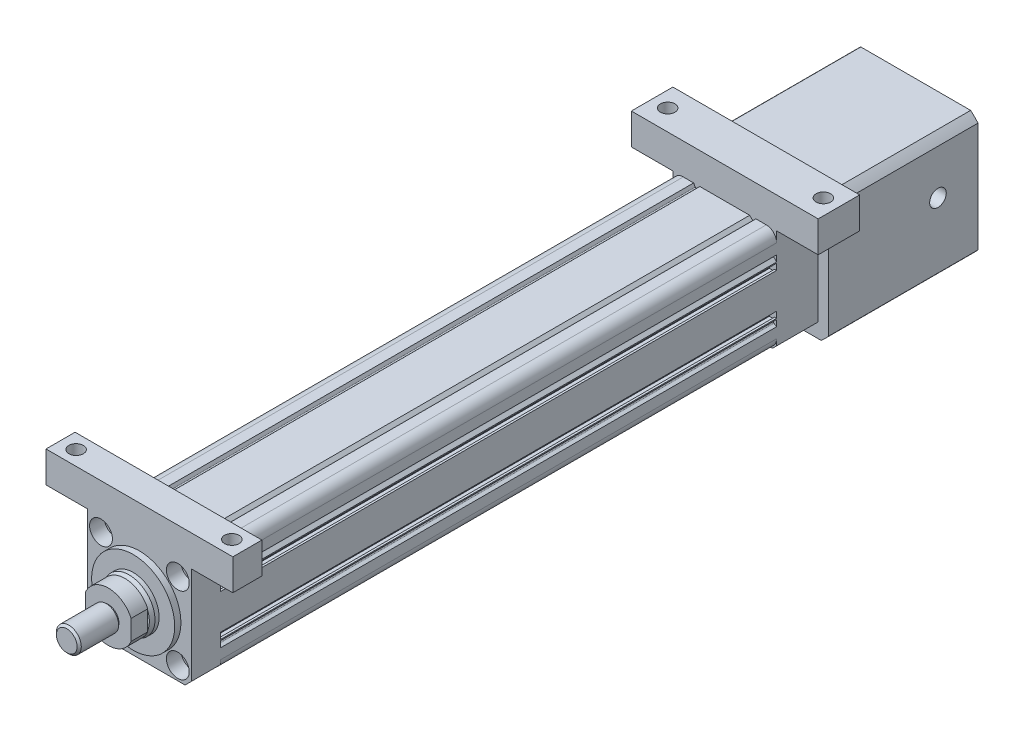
from build123d import *

# Parameters (mm, degrees)
SKETCH_1_R                  = 20
SKETCH_1_R_2                = 2.75
EXTRUDE_1_DEPTH             = 268
FILLET_1_R                  = 5
EXTRUDE_2_DEPTH             = 14
SKETCH_3_R                  = 20
EXTRUDE_3_DEPTH             = 3
SKETCH_5_R                  = 12.5
EXTRUDE_4_DEPTH             = 4
CHAMFER_1_SIZE              = 2
CHAMFER_1_SIZE2             = 0.7
EXTRUDE_5_DEPTH             = 8
SKETCH_7_R                  = 5.15
EXTRUDE_6_DEPTH             = 1
SKETCH_8_R                  = 6
EXTRUDE_7_DEPTH             = 19
CHAMFER_2_SIZE              = 1
SKETCH_23_W                 = 50
SKETCH_23_H                 = 50
EXTRUDE_8_DEPTH             = 20
HOLE_WIZARD_M6_1_D          = 5
HOLE_WIZARD_M6_1_DEPTH      = 7
HOLE_WIZARD_M6_1_TIP        = 1.502151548
SKETCH_28_W                 = 60
SKETCH_28_H                 = 60
EXTRUDE_9_DEPTH             = 72
SKETCH_4_R                  = 3.5
CUT_EXTRUDE_5_DEPTH         = 30
SKETCH_4_6_R                = 5.5
CUT_EXTRUDE_6_DEPTH         = 7
CUT_EXTRUDE_START           = -72
SKETCH_30_R                 = 3.5
CUT_EXTRUDE_7_DEPTH         = 72
CUT_EXTRUDE_START_2         = -50
SKETCH_30_4_R               = 5.5
CUT_EXTRUDE_8_DEPTH         = 50
HOLE_WIZARD_M5_1_AT_2_COUNT = 2
HOLE_WIZARD_M5_1_AT_2_PITCH = 49.497474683
HOLE_WIZARD_M5_1_AT_3_COUNT = 2
HOLE_WIZARD_M5_1_AT_3_PITCH = 70
HOLE_WIZARD_M5_1_AT_4_COUNT = 2
HOLE_WIZARD_M5_1_AT_4_PITCH = 49.497474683
SKETCH_33_R                 = 19
CUT_EXTRUDE_9_DEPTH         = 65
SKETCH_33_3_R               = 25
CUT_EXTRUDE_10_DEPTH        = 6.5
SKETCH_34_R                 = 50
SKETCH_34_R_2               = 40
CUT_EXTRUDE_2_DEPTH         = 72
SKETCH_35_R                 = 4
CUT_EXTRUDE_11_DEPTH        = 22
SKETCH_36_R                 = 4
CUT_EXTRUDE_12_DEPTH        = 22
SKETCH_37_W                 = 90
SKETCH_37_H                 = 20
SKETCH_37_R                 = 3.5
SKETCH_37_H_2               = 14
EXTRUDE_10_DEPTH            = 15
CHAMFER_4_SIZE              = 2


with BuildPart() as part:
    # Sketch 1 → Extrude 1 (new body)
    with BuildSketch(Plane.XY):
        with BuildLine():
            Line((-25, 25), (-15, 25))
            Line((-15, 25), (-14.227730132, 23.662389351))
            ThreePointArc((-14.227730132, 23.662389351), (-13.859980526, 23.416666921), (-13.441164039, 23.558835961))
            Line((-13.441164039, 23.558835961), (-12, 25))
            Line((-12, 25), (12, 25))
            Line((12, 25), (13.441164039, 23.558835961))
            ThreePointArc((13.441164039, 23.558835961), (13.859980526, 23.416666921), (14.227730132, 23.662389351))
            Line((14.227730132, 23.662389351), (15, 25))
            Line((15, 25), (25, 25))
            Line((25, 25), (25, 15))
            Line((25, 15), (23.662389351, 14.227730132))
            ThreePointArc((23.662389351, 14.227730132), (23.416666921, 13.859980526), (23.558835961, 13.441164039))
            Line((23.558835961, 13.441164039), (25, 12))
            Line((25, 12), (25, 11.5))
            Line((25, 11.5), (24, 11.5))
            Line((24, 11.5), (24, 12.4))
            Line((24, 12.4), (21.5, 12.4))
            Line((21.5, 12.4), (21.5, 7.6))
            Line((21.5, 7.6), (24, 7.6))
            Line((24, 7.6), (24, 8.5))
            Line((24, 8.5), (25, 8.5))
            Line((25, 8.5), (25, -8.5))
            Line((25, -8.5), (24, -8.5))
            Line((24, -8.5), (24, -7.6))
            Line((24, -7.6), (21.5, -7.6))
            Line((21.5, -7.6), (21.5, -12.4))
            Line((21.5, -12.4), (24, -12.4))
            Line((24, -12.4), (24, -11.5))
            Line((24, -11.5), (25, -11.5))
            Line((25, -11.5), (25, -12))
            Line((25, -12), (23.558835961, -13.441164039))
            ThreePointArc((23.558835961, -13.441164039), (23.416666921, -13.859980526), (23.662389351, -14.227730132))
            Line((23.662389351, -14.227730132), (25, -15))
            Line((25, -15), (25, -25))
            Line((25, -25), (15, -25))
            Line((15, -25), (14.227730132, -23.662389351))
            ThreePointArc((14.227730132, -23.662389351), (13.859980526, -23.416666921), (13.441164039, -23.558835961))
            Line((13.441164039, -23.558835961), (12, -25))
            Line((12, -25), (11.5, -25))
            Line((11.5, -25), (11.5, -24))
            Line((11.5, -24), (12.4, -24))
            Line((12.4, -24), (12.4, -21.5))
            Line((12.4, -21.5), (7.6, -21.5))
            Line((7.6, -21.5), (7.6, -24))
            Line((7.6, -24), (8.5, -24))
            Line((8.5, -24), (8.5, -25))
            Line((8.5, -25), (-8.5, -25))
            Line((-8.5, -25), (-8.5, -24))
            Line((-8.5, -24), (-7.6, -24))
            Line((-7.6, -24), (-7.6, -21.5))
            Line((-7.6, -21.5), (-12.4, -21.5))
            Line((-12.4, -21.5), (-12.4, -24))
            Line((-12.4, -24), (-11.5, -24))
            Line((-11.5, -24), (-11.5, -25))
            Line((-11.5, -25), (-12, -25))
            Line((-12, -25), (-13.441164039, -23.558835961))
            ThreePointArc((-13.441164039, -23.558835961), (-13.859980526, -23.416666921), (-14.227730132, -23.662389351))
            Line((-14.227730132, -23.662389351), (-15, -25))
            Line((-15, -25), (-25, -25))
            Line((-25, -25), (-25, -15))
            Line((-25, -15), (-23.662389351, -14.227730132))
            ThreePointArc((-23.662389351, -14.227730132), (-23.416666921, -13.859980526), (-23.558835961, -13.441164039))
            Line((-23.558835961, -13.441164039), (-25, -12))
            Line((-25, -12), (-25, -11.5))
            Line((-25, -11.5), (-24, -11.5))
            Line((-24, -11.5), (-24, -12.4))
            Line((-24, -12.4), (-21.5, -12.4))
            Line((-21.5, -12.4), (-21.5, -7.6))
            Line((-21.5, -7.6), (-24, -7.6))
            Line((-24, -7.6), (-24, -8.5))
            Line((-24, -8.5), (-25, -8.5))
            Line((-25, -8.5), (-25, 8.5))
            Line((-25, 8.5), (-24, 8.5))
            Line((-24, 8.5), (-24, 7.6))
            Line((-24, 7.6), (-21.5, 7.6))
            Line((-21.5, 7.6), (-21.5, 12.4))
            Line((-21.5, 12.4), (-24, 12.4))
            Line((-24, 12.4), (-24, 11.5))
            Line((-24, 11.5), (-25, 11.5))
            Line((-25, 11.5), (-25, 12))
            Line((-25, 12), (-23.558835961, 13.441164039))
            ThreePointArc((-23.558835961, 13.441164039), (-23.416666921, 13.859980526), (-23.662389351, 14.227730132))
            Line((-23.662389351, 14.227730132), (-25, 15))
            Line((-25, 15), (-25, 25))
        make_face()
        Circle(SKETCH_1_R, mode=Mode.SUBTRACT)
        with Locations((-18.5, 18.5)):
            Circle(SKETCH_1_R_2, mode=Mode.SUBTRACT)
        with Locations((18.5, 18.5)):
            Circle(SKETCH_1_R_2, mode=Mode.SUBTRACT)
        with Locations((18.5, -18.5)):
            Circle(SKETCH_1_R_2, mode=Mode.SUBTRACT)
        with Locations((-18.5, -18.5)):
            Circle(SKETCH_1_R_2, mode=Mode.SUBTRACT)
        with BuildLine():
            Line((-13.868836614, 23), (-5, 23))
            ThreePointArc((-5, 23), (-4.502985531, 22.554558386), (-4.891534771, 22.01190647))
            ThreePointArc((-4.891534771, 22.01190647), (-10.498377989, 19.955831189), (-15.368836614, 16.5))
            Line((-15.368836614, 16.5), (-15.368836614, 21.5))
            Line((-15.368836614, 21.5), (-13.868836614, 23))
        make_face(mode=Mode.SUBTRACT)
        with BuildLine():
            Line((15.368836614, 16.5), (15.368836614, 21.5))
            Line((15.368836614, 21.5), (13.868836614, 23))
            Line((13.868836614, 23), (5, 23))
            ThreePointArc((5, 23), (4.502985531, 22.554558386), (4.891534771, 22.01190647))
            ThreePointArc((4.891534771, 22.01190647), (10.498377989, 19.955831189), (15.368836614, 16.5))
        make_face(mode=Mode.SUBTRACT)
    extrude(amount=EXTRUDE_1_DEPTH)

    # Fillet 1
    fillet_1_edges = [part.edges().sort_by_distance(p)[0] for p in [
        (-25, 25, 134),
        (25, 25, 134),
        (25, -25, 134),
        (-25, -25, 134),
    ]]
    fillet(fillet_1_edges, radius=FILLET_1_R)

    # Sketch 2 → Extrude 2 (add)
    with BuildSketch(Plane.XY.offset(268)):
        Polygon((-22, 25), (22, 25), (25, 25), (25, 22), (25, -22), (22, -25), (-22, -25), (-25, -22), (-25, 22), (-25, 25), align=None)
    extrude(amount=EXTRUDE_2_DEPTH)

    # Sketch 3 → Extrude 3 (add)
    with BuildSketch(Plane.XY.offset(282)):
        Circle(SKETCH_3_R)
    extrude(amount=EXTRUDE_3_DEPTH)

    # Sketch 5 → Extrude 4 (add)
    with BuildSketch(Plane.XY.offset(285)):
        Circle(SKETCH_5_R)
    extrude(amount=EXTRUDE_4_DEPTH)

    # Chamfer 1
    chamfer_1_edges = [part.edges().sort_by_distance(p)[0] for p in [
        (-12.5, 0, 289),
    ]]
    chamfer_1_side = [part.faces().sort_by_distance(p)[0] for p in [
        (-12.5, 0, 287),
    ]]
    chamfer(chamfer_1_edges, length=CHAMFER_1_SIZE, length2=CHAMFER_1_SIZE2, reference=chamfer_1_side[0])

    # Sketch 6 → Extrude 5 (add)
    with BuildSketch(Plane.XY.offset(289)):
        with BuildLine():
            Line((-11, 4.795831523), (-11, -4.795831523))
            ThreePointArc((-11, -4.795831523), (0, -12), (11, -4.795831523))
            Line((11, -4.795831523), (11, 4.795831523))
            ThreePointArc((11, 4.795831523), (0, 12), (-11, 4.795831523))
        make_face()
    extrude(amount=EXTRUDE_5_DEPTH)

    # Sketch 7 → Extrude 6 (add)
    with BuildSketch(Plane.XY.offset(297)):
        Circle(SKETCH_7_R)
    extrude(amount=EXTRUDE_6_DEPTH)

    # Sketch 8 → Extrude 7 (add)
    with BuildSketch(Plane.XY.offset(298)):
        Circle(SKETCH_8_R)
    extrude(amount=EXTRUDE_7_DEPTH)

    # Chamfer 2
    chamfer_2_edges = [part.edges().sort_by_distance(p)[0] for p in [
        (-6, 0, 317),
    ]]
    chamfer(chamfer_2_edges, length=CHAMFER_2_SIZE)

    # Sketch 23 → Extrude 8 (add)
    with BuildSketch(Plane(origin=(0, 0, 0), x_dir=(-1, 0, 0), z_dir=(0, 0, -1))):
        Rectangle(SKETCH_23_W, SKETCH_23_H)
    extrude(amount=EXTRUDE_8_DEPTH)

    # Hole Wizard M6 _1
    with Locations(Plane(origin=(0, -25, 0), x_dir=(-1, 0, 0), z_dir=(0, -1, 0))):
        with Locations((0, 12)):
            Hole(HOLE_WIZARD_M6_1_D / 2, depth=HOLE_WIZARD_M6_1_DEPTH)
            with Locations((0, 0, -(HOLE_WIZARD_M6_1_DEPTH + HOLE_WIZARD_M6_1_TIP / 2))):  # 118° drill point
                Cone(0, HOLE_WIZARD_M6_1_D / 2, HOLE_WIZARD_M6_1_TIP, mode=Mode.SUBTRACT)

    # Sketch 4 → Cut-Extrude 5 (cut)
    with BuildSketch(Plane.XY.offset(282)):
        with Locations((-35, 17.5)):
            Circle(SKETCH_4_R)
        with Locations((-18.5, 18.5)):
            Circle(SKETCH_4_R)
        with Locations(Location((-18.5, -18.5, 0), (0, 0, 180))):
            Circle(SKETCH_4_R)
        with Locations((-35, -17.5)):
            Circle(SKETCH_4_R)
        with Locations((35, -17.5)):
            Circle(SKETCH_4_R)
        with Locations((18.5, -18.5)):
            Circle(SKETCH_4_R)
        with Locations(Location((18.5, 18.5, 0), (0, 0, 206.540580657))):
            Circle(SKETCH_4_R)
        with Locations((35, 17.5)):
            Circle(SKETCH_4_R)
    extrude(amount=-CUT_EXTRUDE_5_DEPTH, mode=Mode.SUBTRACT)

    # Sketch 4_6 → Cut-Extrude 6 (cut)
    with BuildSketch(Plane.XY.offset(282)):
        with Locations((-18.5, 18.5)):
            Circle(SKETCH_4_6_R)
        with Locations(Location((-18.5, -18.5, 0), (0, 0, 180))):
            Circle(SKETCH_4_6_R)
        with Locations((18.5, -18.5)):
            Circle(SKETCH_4_6_R)
        with Locations(Location((18.5, 18.5, 0), (0, 0, 180))):
            Circle(SKETCH_4_6_R)
    extrude(amount=-CUT_EXTRUDE_6_DEPTH, mode=Mode.SUBTRACT)



with BuildPart() as body_2:
    # Sketch 28 → Extrude 9 (new body)
    with BuildSketch(Plane(origin=(0, 0, -20), x_dir=(-1, 0, 0), z_dir=(0, 0, -1))):
        Rectangle(SKETCH_28_W, SKETCH_28_H)
    extrude(amount=EXTRUDE_9_DEPTH)

    # Sketch 30 → Cut-Extrude 7 (cut)
    with BuildSketch(Plane(origin=(0, 0, -92), x_dir=(-1, 0, 0), z_dir=(0, 0, -1)).offset(CUT_EXTRUDE_START)):
        with Locations((-16.099900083, 18.5)):
            Circle(SKETCH_30_R)
        with Locations((19.700049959, 17.299950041)):
            Circle(SKETCH_30_R)
        with Locations((18.5, -18.5)):
            Circle(SKETCH_30_R)
        with Locations((-17.299950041, -17.299950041)):
            Circle(SKETCH_30_R)
    extrude(amount=CUT_EXTRUDE_7_DEPTH, mode=Mode.SUBTRACT)

    # Sketch 30_4 → Cut-Extrude 8 (cut)
    with BuildSketch(Plane(origin=(0, 0, -92), x_dir=(-1, 0, 0), z_dir=(0, 0, -1)).offset(CUT_EXTRUDE_START_2)):
        with Locations((18.5, -18.5)):
            Circle(SKETCH_30_4_R)
        with Locations((-17.299950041, -17.299950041)):
            Circle(SKETCH_30_4_R)
        with Locations((-16.099900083, 18.5)):
            Circle(SKETCH_30_4_R)
        with Locations((19.700049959, 17.299950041)):
            Circle(SKETCH_30_4_R)
    extrude(amount=CUT_EXTRUDE_8_DEPTH, mode=Mode.SUBTRACT)

    # Sketch 32 → Hole Wizard M5 _1 (revolve, cut)
    with BuildSketch(Plane(origin=(-24.748737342, -24.748737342, -92), x_dir=(0, 1, 0), z_dir=(1, 0, 0))):
        Polygon((0, 0), (0, 15.2618073), (2.1, 14), (2.1, 0), align=None)
    hole_wizard_m5_1 = revolve(axis=Axis((-24.748737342, -24.748737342, -98.35), (0, 0, 1)), mode=Mode.SUBTRACT)

    # Hole Wizard M5 _1 at 2: Hole Wizard M5 _1 ×2
    with Locations(*[(i * HOLE_WIZARD_M5_1_AT_2_PITCH, 0, 0) for i in range(1, HOLE_WIZARD_M5_1_AT_2_COUNT)]):
        add(hole_wizard_m5_1, mode=Mode.SUBTRACT)

    # Hole Wizard M5 _1 at 3: Hole Wizard M5 _1 ×2
    with Locations(*[Vector(0.7071067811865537, 0.7071067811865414, 0) * (i * HOLE_WIZARD_M5_1_AT_3_PITCH) for i in range(1, HOLE_WIZARD_M5_1_AT_3_COUNT)]):
        add(hole_wizard_m5_1, mode=Mode.SUBTRACT)

    # Hole Wizard M5 _1 at 4: Hole Wizard M5 _1 ×2
    with Locations(*[(0, i * HOLE_WIZARD_M5_1_AT_4_PITCH, 0) for i in range(1, HOLE_WIZARD_M5_1_AT_4_COUNT)]):
        add(hole_wizard_m5_1, mode=Mode.SUBTRACT)

    # Sketch 33 → Cut-Extrude 9 (cut)
    with BuildSketch(Plane(origin=(0, 0, -92), x_dir=(-1, 0, 0), z_dir=(0, 0, -1))):
        Circle(SKETCH_33_R)
    extrude(amount=-CUT_EXTRUDE_9_DEPTH, mode=Mode.SUBTRACT)

    # Sketch 33_3 → Cut-Extrude 10 (cut)
    with BuildSketch(Plane(origin=(0, 0, -92), x_dir=(-1, 0, 0), z_dir=(0, 0, -1))):
        Circle(SKETCH_33_3_R)
    extrude(amount=-CUT_EXTRUDE_10_DEPTH, mode=Mode.SUBTRACT)

    # Sketch 34 → Cut-Extrude 2 (cut)
    with BuildSketch(Plane(origin=(0, 0, -92), x_dir=(-1, 0, 0), z_dir=(0, 0, -1))):
        Circle(SKETCH_34_R)
        Circle(SKETCH_34_R_2, mode=Mode.SUBTRACT)
    extrude(amount=-CUT_EXTRUDE_2_DEPTH, mode=Mode.SUBTRACT)

    # Sketch 35 → Cut-Extrude 11 (cut)
    with BuildSketch(Plane(origin=(30, 0, 0), x_dir=(0, 0, -1), z_dir=(1, 0, 0))):
        with Locations((72.713697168, 4.902306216)):
            Circle(SKETCH_35_R)
    extrude(amount=-CUT_EXTRUDE_11_DEPTH, mode=Mode.SUBTRACT)

    # Sketch 36 → Cut-Extrude 12 (cut)
    with BuildSketch(Plane.ZY.offset(30)):
        with Locations((-37.731412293, -10.555978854)):
            Circle(SKETCH_36_R)
    extrude(amount=-CUT_EXTRUDE_12_DEPTH, mode=Mode.SUBTRACT)


with BuildPart() as part_1:
    add(part.part)

    add(body_2.part)  # Extrude 10 merges body 2
    # Sketch 37 → Extrude 10 (add)
    # profile 1 of 2: a face of its own
    with BuildSketch(Plane(origin=(0, 25, 0), x_dir=(1, 0, 0), z_dir=(0, 1, 0))):
        with Locations((0, 10)):
            Rectangle(SKETCH_37_W, SKETCH_37_H)
        with Locations(Location((37.5, 10, 0), (0, 0, 180))):
            Circle(SKETCH_37_R, mode=Mode.SUBTRACT)
        with Locations(Location((-37.5, 10, 0), (0, 0, 180))):
            Circle(SKETCH_37_R, mode=Mode.SUBTRACT)
    # profile 2 of 2: a face of its own
    with BuildSketch(Plane(origin=(0, 25, 0), x_dir=(1, 0, 0), z_dir=(0, 1, 0))):
        with Locations((0, -275)):
            Rectangle(SKETCH_37_W, SKETCH_37_H_2)
        with Locations(Location((37.5, -275, 0), (0, 0, 180))):
            Circle(SKETCH_37_R, mode=Mode.SUBTRACT)
        with Locations(Location((-37.5, -275, 0), (0, 0, 180))):
            Circle(SKETCH_37_R, mode=Mode.SUBTRACT)
    extrude(amount=EXTRUDE_10_DEPTH)

    # Chamfer 4
    chamfer_4_edges = [part_1.edges().sort_by_distance(p)[0] for p in [
        (25, -25, -10),
        (-25, -25, -10),
    ]]
    chamfer(chamfer_4_edges, length=CHAMFER_4_SIZE)


solid = part_1.part
